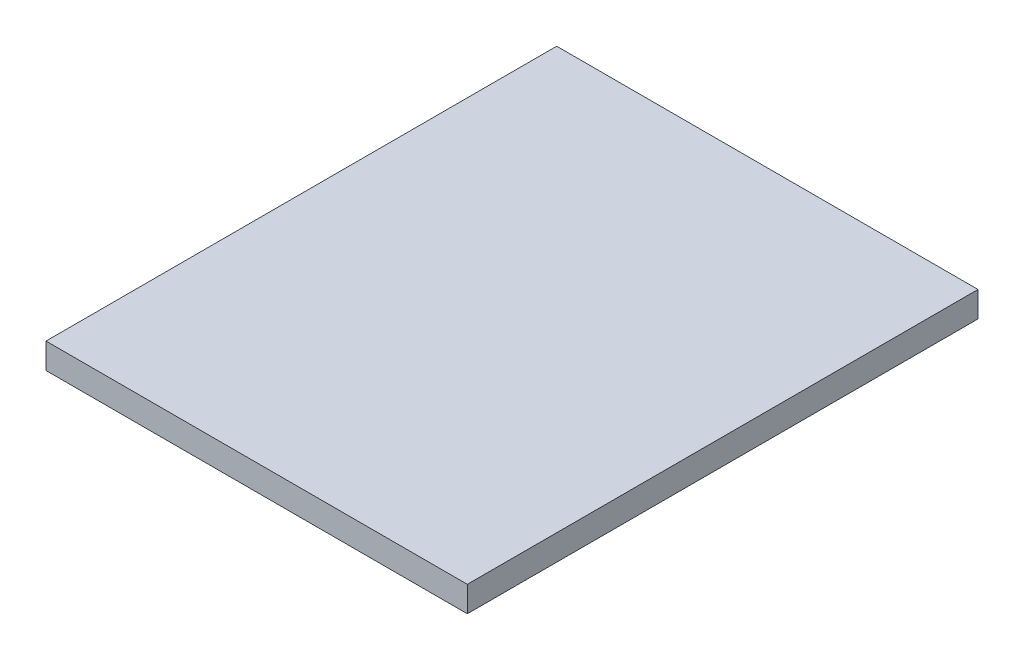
ISO-10303-21;
HEADER;
FILE_DESCRIPTION(('STEP AP214'),'2;1');
FILE_NAME('part.step','',(''),(''),'','','');
FILE_SCHEMA(('AUTOMOTIVE_DESIGN { 1 0 10303 214 1 1 1 1 }'));
ENDSEC;
DATA;
#1=APPLICATION_CONTEXT('core data for automotive mechanical design processes');
#2=APPLICATION_PROTOCOL_DEFINITION('international standard','automotive_design',2000,#1);
#3=PRODUCT_CONTEXT('',#1,'mechanical');
#4=PRODUCT('Part','Part','',(#3));
#5=PRODUCT_RELATED_PRODUCT_CATEGORY('part','',(#4));
#6=PRODUCT_DEFINITION_FORMATION('','',#4);
#7=PRODUCT_DEFINITION_CONTEXT('part definition',#1,'design');
#8=PRODUCT_DEFINITION('design','',#6,#7);
#9=PRODUCT_DEFINITION_SHAPE('','',#8);
#10=(LENGTH_UNIT() NAMED_UNIT(*) SI_UNIT(.MILLI.,.METRE.));
#11=(NAMED_UNIT(*) PLANE_ANGLE_UNIT() SI_UNIT($,.RADIAN.));
#12=(NAMED_UNIT(*) SI_UNIT($,.STERADIAN.) SOLID_ANGLE_UNIT());
#13=UNCERTAINTY_MEASURE_WITH_UNIT(LENGTH_MEASURE(1.E-05),#10,'distance_accuracy_value','');
#14=(GEOMETRIC_REPRESENTATION_CONTEXT(3) GLOBAL_UNCERTAINTY_ASSIGNED_CONTEXT((#13)) GLOBAL_UNIT_ASSIGNED_CONTEXT((#10,
#11,#12)) REPRESENTATION_CONTEXT('',''));
#15=CARTESIAN_POINT('',(0.,0.,0.));
#16=DIRECTION('',(0.,0.,1.));
#17=DIRECTION('',(1.,0.,0.));
#18=AXIS2_PLACEMENT_3D('',#15,#16,#17);
#19=CARTESIAN_POINT('',(0.,2.,-20.));
#20=DIRECTION('',(1.,0.,0.));
#21=DIRECTION('',(0.,0.,-1.));
#22=AXIS2_PLACEMENT_3D('',#19,#20,#21);
#23=PLANE('',#22);
#24=DIRECTION('',(0.,0.,1.));
#25=VECTOR('',#24,1.);
#26=CARTESIAN_POINT('',(0.,0.,-20.));
#27=LINE('',#26,#25);
#28=CARTESIAN_POINT('',(0.,0.,-20.));
#29=VERTEX_POINT('',#28);
#30=CARTESIAN_POINT('',(0.,0.,20.));
#31=VERTEX_POINT('',#30);
#32=EDGE_CURVE('E70',#29,#31,#27,.T.);
#33=ORIENTED_EDGE('',*,*,#32,.T.);
#34=DIRECTION('',(0.,-1.,0.));
#35=VECTOR('',#34,1.);
#36=CARTESIAN_POINT('',(0.,2.,20.));
#37=LINE('',#36,#35);
#38=CARTESIAN_POINT('',(0.,2.,20.));
#39=VERTEX_POINT('',#38);
#40=EDGE_CURVE('E11',#39,#31,#37,.T.);
#41=ORIENTED_EDGE('',*,*,#40,.F.);
#42=DIRECTION('',(0.,0.,1.));
#43=VECTOR('',#42,1.);
#44=CARTESIAN_POINT('',(0.,2.,-20.));
#45=LINE('',#44,#43);
#46=CARTESIAN_POINT('',(0.,2.,-20.));
#47=VERTEX_POINT('',#46);
#48=EDGE_CURVE('E88',#47,#39,#45,.T.);
#49=ORIENTED_EDGE('',*,*,#48,.F.);
#50=DIRECTION('',(0.,-1.,0.));
#51=VECTOR('',#50,1.);
#52=CARTESIAN_POINT('',(0.,2.,-20.));
#53=LINE('',#52,#51);
#54=EDGE_CURVE('E82',#47,#29,#53,.T.);
#55=ORIENTED_EDGE('',*,*,#54,.T.);
#56=EDGE_LOOP('',(#33,#41,#49,#55));
#57=FACE_BOUND('',#56,.T.);
#58=ADVANCED_FACE('F26',(#57),#23,.F.);
#59=CARTESIAN_POINT('',(0.,2.,20.));
#60=DIRECTION('',(0.,0.,-1.));
#61=DIRECTION('',(-1.,0.,0.));
#62=AXIS2_PLACEMENT_3D('',#59,#60,#61);
#63=PLANE('',#62);
#64=DIRECTION('',(1.,0.,0.));
#65=VECTOR('',#64,1.);
#66=CARTESIAN_POINT('',(0.,0.,20.));
#67=LINE('',#66,#65);
#68=CARTESIAN_POINT('',(33.,0.,20.));
#69=VERTEX_POINT('',#68);
#70=EDGE_CURVE('E66',#31,#69,#67,.T.);
#71=ORIENTED_EDGE('',*,*,#70,.T.);
#72=DIRECTION('',(0.,-1.,0.));
#73=VECTOR('',#72,1.);
#74=CARTESIAN_POINT('',(33.,2.,20.));
#75=LINE('',#74,#73);
#76=CARTESIAN_POINT('',(33.,2.,20.));
#77=VERTEX_POINT('',#76);
#78=EDGE_CURVE('E33',#77,#69,#75,.T.);
#79=ORIENTED_EDGE('',*,*,#78,.F.);
#80=DIRECTION('',(1.,0.,0.));
#81=VECTOR('',#80,1.);
#82=CARTESIAN_POINT('',(0.,2.,20.));
#83=LINE('',#82,#81);
#84=EDGE_CURVE('E78',#39,#77,#83,.T.);
#85=ORIENTED_EDGE('',*,*,#84,.F.);
#86=ORIENTED_EDGE('',*,*,#40,.T.);
#87=EDGE_LOOP('',(#71,#79,#85,#86));
#88=FACE_BOUND('',#87,.T.);
#89=ADVANCED_FACE('F77',(#88),#63,.F.);
#90=CARTESIAN_POINT('',(33.,2.,-20.));
#91=DIRECTION('',(-1.,0.,0.));
#92=DIRECTION('',(0.,0.,1.));
#93=AXIS2_PLACEMENT_3D('',#90,#91,#92);
#94=PLANE('',#93);
#95=DIRECTION('',(0.,0.,-1.));
#96=VECTOR('',#95,1.);
#97=CARTESIAN_POINT('',(33.,0.,-20.));
#98=LINE('',#97,#96);
#99=CARTESIAN_POINT('',(33.,0.,-20.));
#100=VERTEX_POINT('',#99);
#101=EDGE_CURVE('E71',#69,#100,#98,.T.);
#102=ORIENTED_EDGE('',*,*,#101,.T.);
#103=DIRECTION('',(0.,-1.,0.));
#104=VECTOR('',#103,1.);
#105=CARTESIAN_POINT('',(33.,2.,-20.));
#106=LINE('',#105,#104);
#107=CARTESIAN_POINT('',(33.,2.,-20.));
#108=VERTEX_POINT('',#107);
#109=EDGE_CURVE('E94',#108,#100,#106,.T.);
#110=ORIENTED_EDGE('',*,*,#109,.F.);
#111=DIRECTION('',(0.,0.,-1.));
#112=VECTOR('',#111,1.);
#113=CARTESIAN_POINT('',(33.,2.,-20.));
#114=LINE('',#113,#112);
#115=EDGE_CURVE('E45',#77,#108,#114,.T.);
#116=ORIENTED_EDGE('',*,*,#115,.F.);
#117=ORIENTED_EDGE('',*,*,#78,.T.);
#118=EDGE_LOOP('',(#102,#110,#116,#117));
#119=FACE_BOUND('',#118,.T.);
#120=ADVANCED_FACE('F97',(#119),#94,.F.);
#121=CARTESIAN_POINT('',(0.,2.,-20.));
#122=DIRECTION('',(0.,0.,1.));
#123=DIRECTION('',(1.,0.,0.));
#124=AXIS2_PLACEMENT_3D('',#121,#122,#123);
#125=PLANE('',#124);
#126=DIRECTION('',(-1.,0.,0.));
#127=VECTOR('',#126,1.);
#128=CARTESIAN_POINT('',(0.,0.,-20.));
#129=LINE('',#128,#127);
#130=EDGE_CURVE('E86',#100,#29,#129,.T.);
#131=ORIENTED_EDGE('',*,*,#130,.T.);
#132=ORIENTED_EDGE('',*,*,#54,.F.);
#133=DIRECTION('',(-1.,0.,0.));
#134=VECTOR('',#133,1.);
#135=CARTESIAN_POINT('',(0.,2.,-20.));
#136=LINE('',#135,#134);
#137=EDGE_CURVE('E40',#108,#47,#136,.T.);
#138=ORIENTED_EDGE('',*,*,#137,.F.);
#139=ORIENTED_EDGE('',*,*,#109,.T.);
#140=EDGE_LOOP('',(#131,#132,#138,#139));
#141=FACE_BOUND('',#140,.T.);
#142=ADVANCED_FACE('F99',(#141),#125,.F.);
#143=CARTESIAN_POINT('',(0.,2.,20.));
#144=DIRECTION('',(0.,1.,0.));
#145=DIRECTION('',(0.,0.,1.));
#146=AXIS2_PLACEMENT_3D('',#143,#144,#145);
#147=PLANE('',#146);
#148=ORIENTED_EDGE('',*,*,#48,.T.);
#149=ORIENTED_EDGE('',*,*,#84,.T.);
#150=ORIENTED_EDGE('',*,*,#115,.T.);
#151=ORIENTED_EDGE('',*,*,#137,.T.);
#152=EDGE_LOOP('',(#148,#149,#150,#151));
#153=FACE_BOUND('',#152,.T.);
#154=ADVANCED_FACE('F100',(#153),#147,.T.);
#155=CARTESIAN_POINT('',(0.,0.,20.));
#156=DIRECTION('',(0.,1.,0.));
#157=DIRECTION('',(0.,0.,1.));
#158=AXIS2_PLACEMENT_3D('',#155,#156,#157);
#159=PLANE('',#158);
#160=ORIENTED_EDGE('',*,*,#32,.F.);
#161=ORIENTED_EDGE('',*,*,#130,.F.);
#162=ORIENTED_EDGE('',*,*,#101,.F.);
#163=ORIENTED_EDGE('',*,*,#70,.F.);
#164=EDGE_LOOP('',(#160,#161,#162,#163));
#165=FACE_BOUND('',#164,.T.);
#166=ADVANCED_FACE('F67',(#165),#159,.F.);
#167=CLOSED_SHELL('',(#58,#89,#120,#142,#154,#166));
#168=MANIFOLD_SOLID_BREP('B2',#167);
#169=ADVANCED_BREP_SHAPE_REPRESENTATION('',(#18,#168),#14);
#170=SHAPE_DEFINITION_REPRESENTATION(#9,#169);
ENDSEC;
END-ISO-10303-21;
